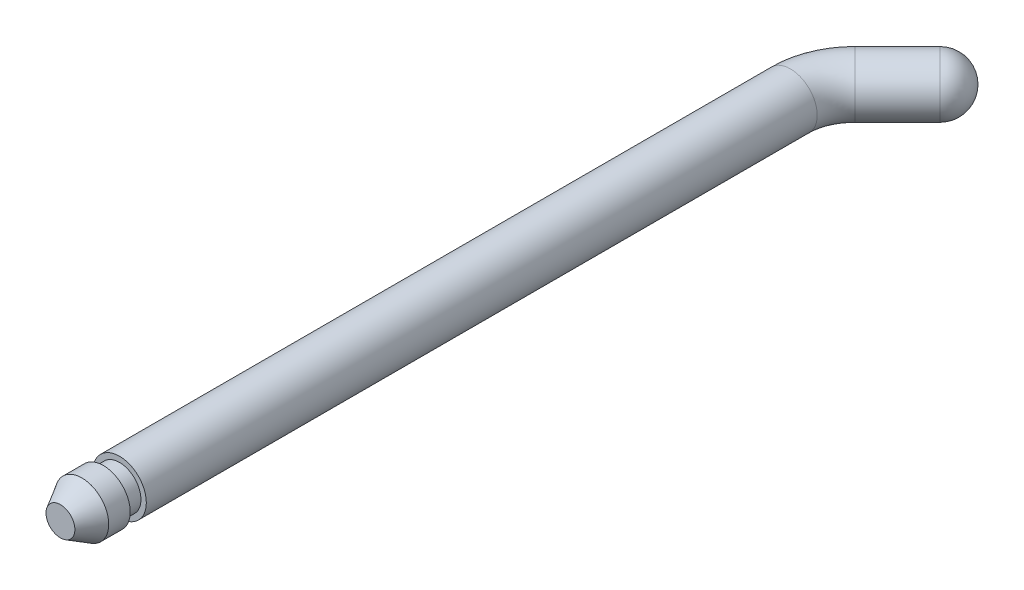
ISO-10303-21;
HEADER;
FILE_DESCRIPTION(('STEP AP214'),'2;1');
FILE_NAME('part.step','',(''),(''),'','','');
FILE_SCHEMA(('AUTOMOTIVE_DESIGN { 1 0 10303 214 1 1 1 1 }'));
ENDSEC;
DATA;
#1=APPLICATION_CONTEXT('core data for automotive mechanical design processes');
#2=APPLICATION_PROTOCOL_DEFINITION('international standard','automotive_design',2000,#1);
#3=PRODUCT_CONTEXT('',#1,'mechanical');
#4=PRODUCT('Part','Part','',(#3));
#5=PRODUCT_RELATED_PRODUCT_CATEGORY('part','',(#4));
#6=PRODUCT_DEFINITION_FORMATION('','',#4);
#7=PRODUCT_DEFINITION_CONTEXT('part definition',#1,'design');
#8=PRODUCT_DEFINITION('design','',#6,#7);
#9=PRODUCT_DEFINITION_SHAPE('','',#8);
#10=(LENGTH_UNIT() NAMED_UNIT(*) SI_UNIT(.MILLI.,.METRE.));
#11=(NAMED_UNIT(*) PLANE_ANGLE_UNIT() SI_UNIT($,.RADIAN.));
#12=(NAMED_UNIT(*) SI_UNIT($,.STERADIAN.) SOLID_ANGLE_UNIT());
#13=UNCERTAINTY_MEASURE_WITH_UNIT(LENGTH_MEASURE(1.E-05),#10,'distance_accuracy_value','');
#14=(GEOMETRIC_REPRESENTATION_CONTEXT(3) GLOBAL_UNCERTAINTY_ASSIGNED_CONTEXT((#13)) GLOBAL_UNIT_ASSIGNED_CONTEXT((#10,
#11,#12)) REPRESENTATION_CONTEXT('',''));
#15=CARTESIAN_POINT('',(0.,0.,0.));
#16=DIRECTION('',(0.,0.,1.));
#17=DIRECTION('',(1.,0.,0.));
#18=AXIS2_PLACEMENT_3D('',#15,#16,#17);
#19=CARTESIAN_POINT('',(0.,0.,-66.));
#20=DIRECTION('',(0.,0.,1.));
#21=DIRECTION('',(1.,0.,0.));
#22=AXIS2_PLACEMENT_3D('',#19,#20,#21);
#23=CYLINDRICAL_SURFACE('',#22,2.5);
#24=CARTESIAN_POINT('',(0.,0.,-66.));
#25=DIRECTION('',(0.,0.,1.));
#26=DIRECTION('',(1.,0.,0.));
#27=AXIS2_PLACEMENT_3D('',#24,#25,#26);
#28=CIRCLE('',#27,2.5);
#29=CARTESIAN_POINT('',(-2.5,0.,-66.));
#30=VERTEX_POINT('',#29);
#31=EDGE_CURVE('E25',#30,#30,#28,.T.);
#32=ORIENTED_EDGE('',*,*,#31,.T.);
#33=EDGE_LOOP('',(#32));
#34=FACE_BOUND('',#33,.T.);
#35=CARTESIAN_POINT('',(0.,0.,-3.5));
#36=DIRECTION('',(0.,0.,1.));
#37=DIRECTION('',(1.,0.,0.));
#38=AXIS2_PLACEMENT_3D('',#35,#36,#37);
#39=CIRCLE('',#38,2.5);
#40=CARTESIAN_POINT('',(2.5,0.,-3.5));
#41=VERTEX_POINT('',#40);
#42=EDGE_CURVE('E28',#41,#41,#39,.F.);
#43=ORIENTED_EDGE('',*,*,#42,.T.);
#44=EDGE_LOOP('',(#43));
#45=FACE_BOUND('',#44,.T.);
#46=ADVANCED_FACE('F12',(#34,#45),#23,.T.);
#47=CARTESIAN_POINT('',(1.75735931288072,0.,-70.2426406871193));
#48=DIRECTION('',(0.707106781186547,0.,-0.707106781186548));
#49=DIRECTION('',(-0.707106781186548,0.,-0.707106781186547));
#50=AXIS2_PLACEMENT_3D('',#47,#48,#49);
#51=CYLINDRICAL_SURFACE('',#50,2.5);
#52=CARTESIAN_POINT('',(1.75735931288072,0.,-70.2426406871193));
#53=DIRECTION('',(-0.707106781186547,0.,0.707106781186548));
#54=DIRECTION('',(0.707106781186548,0.,0.707106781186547));
#55=AXIS2_PLACEMENT_3D('',#52,#53,#54);
#56=CIRCLE('',#55,2.5);
#57=CARTESIAN_POINT('',(-0.0104076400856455,0.,-72.0104076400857));
#58=VERTEX_POINT('',#57);
#59=EDGE_CURVE('E20',#58,#58,#56,.T.);
#60=ORIENTED_EDGE('',*,*,#59,.F.);
#61=EDGE_LOOP('',(#60));
#62=FACE_BOUND('',#61,.T.);
#63=CARTESIAN_POINT('',(5.72762246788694,0.,-74.2129038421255));
#64=DIRECTION('',(-0.707106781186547,0.,0.707106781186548));
#65=DIRECTION('',(0.707106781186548,0.,0.707106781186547));
#66=AXIS2_PLACEMENT_3D('',#63,#64,#65);
#67=CIRCLE('',#66,2.5);
#68=CARTESIAN_POINT('',(7.49538942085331,0.,-72.4451368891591));
#69=VERTEX_POINT('',#68);
#70=EDGE_CURVE('E8',#69,#69,#67,.T.);
#71=ORIENTED_EDGE('',*,*,#70,.T.);
#72=EDGE_LOOP('',(#71));
#73=FACE_BOUND('',#72,.T.);
#74=ADVANCED_FACE('F54',(#62,#73),#51,.T.);
#75=CARTESIAN_POINT('',(6.,0.,-66.));
#76=DIRECTION('',(0.,-1.,0.));
#77=DIRECTION('',(0.,0.,-1.));
#78=AXIS2_PLACEMENT_3D('',#75,#76,#77);
#79=TOROIDAL_SURFACE('',#78,6.,2.5);
#80=CARTESIAN_POINT('',(6.,0.,-66.));
#81=DIRECTION('',(0.,-1.,0.));
#82=DIRECTION('',(0.,0.,-1.));
#83=AXIS2_PLACEMENT_3D('',#80,#81,#82);
#84=CIRCLE('',#83,8.5);
#85=EDGE_CURVE('',#30,#58,#84,.T.);
#86=ORIENTED_EDGE('',*,*,#31,.F.);
#87=ORIENTED_EDGE('',*,*,#59,.T.);
#88=ORIENTED_EDGE('',*,*,#85,.T.);
#89=ORIENTED_EDGE('',*,*,#85,.F.);
#90=EDGE_LOOP('',(#86,#88,#87,#89));
#91=FACE_BOUND('',#90,.T.);
#92=ADVANCED_FACE('F51',(#91),#79,.T.);
#93=CARTESIAN_POINT('',(5.72762246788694,0.,-74.2129038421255));
#94=DIRECTION('',(0.,0.,1.));
#95=DIRECTION('',(1.,0.,0.));
#96=AXIS2_PLACEMENT_3D('',#93,#94,#95);
#97=SPHERICAL_SURFACE('',#96,2.5);
#98=CARTESIAN_POINT('',(5.72762246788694,0.,-74.2129038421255));
#99=DIRECTION('',(-0.707106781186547,0.,0.707106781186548));
#100=DIRECTION('',(0.707106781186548,0.,0.707106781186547));
#101=AXIS2_PLACEMENT_3D('',#98,#99,#100);
#102=SPHERICAL_SURFACE('',#101,2.5);
#103=ORIENTED_EDGE('',*,*,#70,.F.);
#104=EDGE_LOOP('',(#103));
#105=FACE_BOUND('',#104,.T.);
#106=ADVANCED_FACE('F14',(#105),#102,.T.);
#107=CARTESIAN_POINT('',(0.,0.,-66.));
#108=DIRECTION('',(0.,0.,-1.));
#109=DIRECTION('',(-1.,0.,0.));
#110=AXIS2_PLACEMENT_3D('',#107,#108,#109);
#111=CYLINDRICAL_SURFACE('',#110,2.);
#112=CARTESIAN_POINT('',(0.,0.,-2.));
#113=DIRECTION('',(0.,0.,-1.));
#114=DIRECTION('',(-1.,0.,0.));
#115=AXIS2_PLACEMENT_3D('',#112,#113,#114);
#116=CIRCLE('',#115,2.);
#117=CARTESIAN_POINT('',(-2.,0.,-2.));
#118=VERTEX_POINT('',#117);
#119=EDGE_CURVE('E30',#118,#118,#116,.T.);
#120=ORIENTED_EDGE('',*,*,#119,.T.);
#121=EDGE_LOOP('',(#120));
#122=FACE_BOUND('',#121,.T.);
#123=CARTESIAN_POINT('',(0.,0.,-3.5));
#124=DIRECTION('',(0.,0.,-1.));
#125=DIRECTION('',(-1.,0.,0.));
#126=AXIS2_PLACEMENT_3D('',#123,#124,#125);
#127=CIRCLE('',#126,2.);
#128=CARTESIAN_POINT('',(-2.,0.,-3.5));
#129=VERTEX_POINT('',#128);
#130=EDGE_CURVE('E36',#129,#129,#127,.T.);
#131=ORIENTED_EDGE('',*,*,#130,.F.);
#132=EDGE_LOOP('',(#131));
#133=FACE_BOUND('',#132,.T.);
#134=ADVANCED_FACE('F78',(#122,#133),#111,.T.);
#135=CARTESIAN_POINT('',(2.,0.,-2.));
#136=DIRECTION('',(0.,0.,-1.));
#137=DIRECTION('',(-1.,0.,0.));
#138=AXIS2_PLACEMENT_3D('',#135,#136,#137);
#139=PLANE('',#138);
#140=CARTESIAN_POINT('',(0.,0.,-2.));
#141=DIRECTION('',(0.,0.,-1.));
#142=DIRECTION('',(-1.,0.,0.));
#143=AXIS2_PLACEMENT_3D('',#140,#141,#142);
#144=CIRCLE('',#143,2.5);
#145=CARTESIAN_POINT('',(-2.5,0.,-2.));
#146=VERTEX_POINT('',#145);
#147=EDGE_CURVE('E16',#146,#146,#144,.F.);
#148=ORIENTED_EDGE('',*,*,#147,.F.);
#149=EDGE_LOOP('',(#148));
#150=FACE_BOUND('',#149,.T.);
#151=ORIENTED_EDGE('',*,*,#119,.F.);
#152=EDGE_LOOP('',(#151));
#153=FACE_BOUND('',#152,.T.);
#154=ADVANCED_FACE('F81',(#150,#153),#139,.T.);
#155=CARTESIAN_POINT('',(2.,0.,-3.5));
#156=DIRECTION('',(0.,0.,1.));
#157=DIRECTION('',(1.,0.,0.));
#158=AXIS2_PLACEMENT_3D('',#155,#156,#157);
#159=PLANE('',#158);
#160=ORIENTED_EDGE('',*,*,#42,.F.);
#161=EDGE_LOOP('',(#160));
#162=FACE_BOUND('',#161,.T.);
#163=ORIENTED_EDGE('',*,*,#130,.T.);
#164=EDGE_LOOP('',(#163));
#165=FACE_BOUND('',#164,.T.);
#166=ADVANCED_FACE('F76',(#162,#165),#159,.T.);
#167=CARTESIAN_POINT('',(0.,0.,2.));
#168=DIRECTION('',(0.,0.,1.));
#169=DIRECTION('',(1.,0.,0.));
#170=AXIS2_PLACEMENT_3D('',#167,#168,#169);
#171=PLANE('',#170);
#172=CARTESIAN_POINT('',(0.,0.,2.));
#173=DIRECTION('',(0.,0.,-1.));
#174=DIRECTION('',(-1.,0.,0.));
#175=AXIS2_PLACEMENT_3D('',#172,#173,#174);
#176=CIRCLE('',#175,1.3453);
#177=CARTESIAN_POINT('',(-1.3453,0.,2.));
#178=VERTEX_POINT('',#177);
#179=EDGE_CURVE('E34',#178,#178,#176,.T.);
#180=ORIENTED_EDGE('',*,*,#179,.F.);
#181=EDGE_LOOP('',(#180));
#182=FACE_BOUND('',#181,.T.);
#183=ADVANCED_FACE('F72',(#182),#171,.T.);
#184=CARTESIAN_POINT('',(0.,0.,2.));
#185=DIRECTION('',(0.,0.,-1.));
#186=DIRECTION('',(-1.,0.,0.));
#187=AXIS2_PLACEMENT_3D('',#184,#185,#186);
#188=CONICAL_SURFACE('',#187,1.3453,0.523598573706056);
#189=ORIENTED_EDGE('',*,*,#179,.T.);
#190=EDGE_LOOP('',(#189));
#191=FACE_BOUND('',#190,.T.);
#192=CARTESIAN_POINT('',(0.,0.,0.));
#193=DIRECTION('',(0.,0.,1.));
#194=DIRECTION('',(1.,0.,0.));
#195=AXIS2_PLACEMENT_3D('',#192,#193,#194);
#196=CIRCLE('',#195,2.5);
#197=CARTESIAN_POINT('',(2.5,0.,0.));
#198=VERTEX_POINT('',#197);
#199=EDGE_CURVE('E45',#198,#198,#196,.T.);
#200=ORIENTED_EDGE('',*,*,#199,.T.);
#201=EDGE_LOOP('',(#200));
#202=FACE_BOUND('',#201,.T.);
#203=ADVANCED_FACE('F68',(#191,#202),#188,.T.);
#204=ORIENTED_EDGE('',*,*,#199,.F.);
#205=EDGE_LOOP('',(#204));
#206=FACE_BOUND('',#205,.T.);
#207=ORIENTED_EDGE('',*,*,#147,.T.);
#208=EDGE_LOOP('',(#207));
#209=FACE_BOUND('',#208,.T.);
#210=ADVANCED_FACE('F65',(#206,#209),#23,.T.);
#211=CLOSED_SHELL('',(#46,#74,#92,#106,#134,#154,#166,#183,#203,#210));
#212=MANIFOLD_SOLID_BREP('B1',#211);
#213=ADVANCED_BREP_SHAPE_REPRESENTATION('',(#18,#212),#14);
#214=SHAPE_DEFINITION_REPRESENTATION(#9,#213);
ENDSEC;
END-ISO-10303-21;
